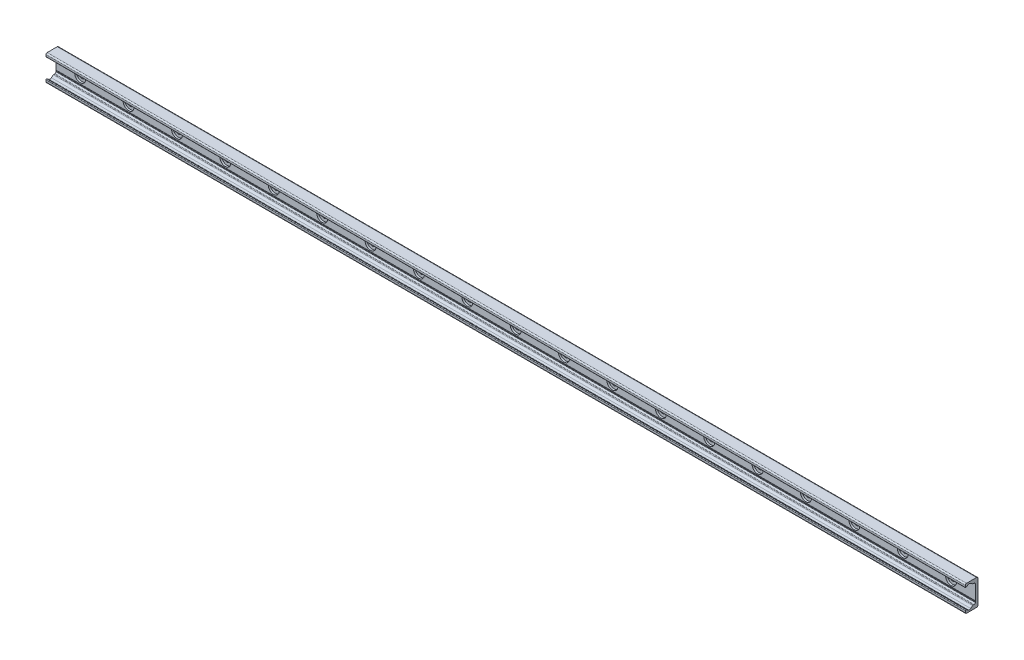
from build123d import *

# Parameters (mm, degrees)
BOSS_EXTRUDE1_DEPTH = 760
SKETCH2_R           = 9
SKETCH2_R_2         = 4.5
CUT_EXTRUDE1_DEPTH  = 3.1
SKETCH2_2_R         = 4.5
CUT_EXTRUDE2_DEPTH  = 761.48307016
LPATTERN1_COUNT     = 19
LPATTERN1_PITCH     = 80


with BuildPart() as part:
    # Sketch1 → Boss-Extrude1 (new, symmetric)
    with BuildSketch(Plane(origin=(0, 0, 0), x_dir=(0, 0, -1), z_dir=(1, 0, 0))):
        with BuildLine():
            Line((0, 0), (0, 19))
            ThreePointArc((0, 19), (-0.732233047, 20.767766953), (-2.5, 21.5))
            Line((-2.5, 21.5), (-19, 21.5))
            ThreePointArc((-19, 21.5), (-20.414213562, 20.914213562), (-21, 19.5))
            Line((-21, 19.5), (-21, 16.625057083))
            ThreePointArc((-21, 16.625057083), (-20.553251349, 15.888838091), (-19.693931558, 15.945160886))
            Line((-19.693931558, 15.945160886), (-16.794305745, 17.975500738))
            ThreePointArc((-16.794305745, 17.975500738), (-14.5, 18.69889256), (-12.205694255, 17.975500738))
            Line((-12.205694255, 17.975500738), (-8.829831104, 15.611695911))
            ThreePointArc((-8.829831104, 15.611695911), (-8.28408983, 15.342566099), (-7.682678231, 15.25))
            Line((-7.682678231, 15.25), (-6.5, 15.25))
            ThreePointArc((-6.5, 15.25), (-5.085786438, 14.664213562), (-4.5, 13.25))
            Line((-4.5, 13.25), (-4.5, -10.75))
            ThreePointArc((-4.5, -10.75), (-4.25, -11), (-4.5, -11.25))
            Line((-4.5, -11.25), (-4.5, -12.25))
            ThreePointArc((-4.5, -12.25), (-4.25, -12.5), (-4.5, -12.75))
            Line((-4.5, -12.75), (-4.5, -13.25))
            ThreePointArc((-4.5, -13.25), (-5.085786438, -14.664213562), (-6.5, -15.25))
            Line((-6.5, -15.25), (-7.682678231, -15.25))
            ThreePointArc((-7.682678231, -15.25), (-8.28408983, -15.342566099), (-8.829831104, -15.611695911))
            Line((-8.829831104, -15.611695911), (-12.205694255, -17.975500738))
            ThreePointArc((-12.205694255, -17.975500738), (-14.5, -18.69889256), (-16.794305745, -17.975500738))
            Line((-16.794305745, -17.975500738), (-19.693931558, -15.945160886))
            ThreePointArc((-19.693931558, -15.945160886), (-20.553251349, -15.888838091), (-21, -16.625057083))
            Line((-21, -16.625057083), (-21, -19.5))
            ThreePointArc((-21, -19.5), (-20.414213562, -20.914213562), (-19, -21.5))
            Line((-19, -21.5), (-2.5, -21.5))
            ThreePointArc((-2.5, -21.5), (-0.732233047, -20.767766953), (0, -19))
            Line((0, -19), (0, 0))
        make_face()
    extrude(amount=BOSS_EXTRUDE1_DEPTH, both=True)

    # Sketch2 → Cut-Extrude1 (cut)
    with BuildSketch(Plane.XY.offset(4.5)):
        with Locations((720, 0)):
            Circle(SKETCH2_R)
        with Locations((720, 0)):
            Circle(SKETCH2_R_2, mode=Mode.SUBTRACT)
    cut_extrude1 = extrude(amount=-CUT_EXTRUDE1_DEPTH, mode=Mode.SUBTRACT)

    # Sketch2_2 → Cut-Extrude2 (cut, through all)
    with BuildSketch(Plane.XY.offset(4.5)):
        with Locations((720, 0)):
            Circle(SKETCH2_2_R)
    cut_extrude2 = extrude(amount=-CUT_EXTRUDE2_DEPTH, mode=Mode.SUBTRACT)

    # LPattern1: Cut-Extrude1, Cut-Extrude2 ×19
    with Locations(*[(-i * LPATTERN1_PITCH, 0, 0) for i in range(1, LPATTERN1_COUNT)]):
        add(cut_extrude1, mode=Mode.SUBTRACT)
        add(cut_extrude2, mode=Mode.SUBTRACT)


solid = part.part
